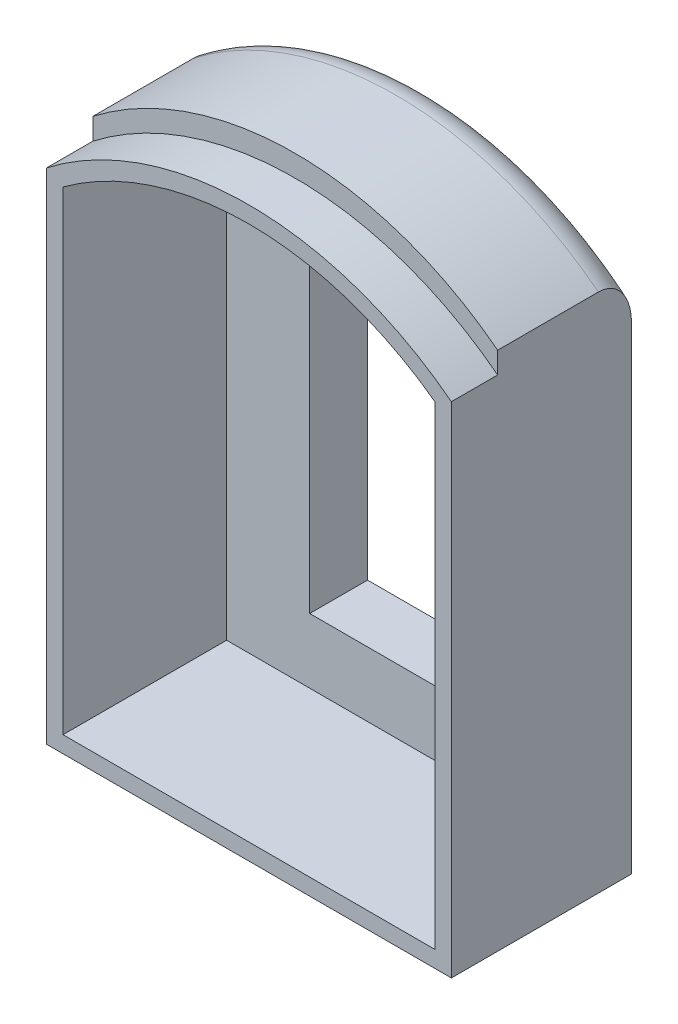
ISO-10303-21;
HEADER;
FILE_DESCRIPTION(('STEP AP214'),'2;1');
FILE_NAME('part.step','',(''),(''),'','','');
FILE_SCHEMA(('AUTOMOTIVE_DESIGN { 1 0 10303 214 1 1 1 1 }'));
ENDSEC;
DATA;
#1=APPLICATION_CONTEXT('core data for automotive mechanical design processes');
#2=APPLICATION_PROTOCOL_DEFINITION('international standard','automotive_design',2000,#1);
#3=PRODUCT_CONTEXT('',#1,'mechanical');
#4=PRODUCT('Part','Part','',(#3));
#5=PRODUCT_RELATED_PRODUCT_CATEGORY('part','',(#4));
#6=PRODUCT_DEFINITION_FORMATION('','',#4);
#7=PRODUCT_DEFINITION_CONTEXT('part definition',#1,'design');
#8=PRODUCT_DEFINITION('design','',#6,#7);
#9=PRODUCT_DEFINITION_SHAPE('','',#8);
#10=(LENGTH_UNIT() NAMED_UNIT(*) SI_UNIT(.MILLI.,.METRE.));
#11=(NAMED_UNIT(*) PLANE_ANGLE_UNIT() SI_UNIT($,.RADIAN.));
#12=(NAMED_UNIT(*) SI_UNIT($,.STERADIAN.) SOLID_ANGLE_UNIT());
#13=UNCERTAINTY_MEASURE_WITH_UNIT(LENGTH_MEASURE(1.E-05),#10,'distance_accuracy_value','');
#14=(GEOMETRIC_REPRESENTATION_CONTEXT(3) GLOBAL_UNCERTAINTY_ASSIGNED_CONTEXT((#13)) GLOBAL_UNIT_ASSIGNED_CONTEXT((#10,
#11,#12)) REPRESENTATION_CONTEXT('',''));
#15=CARTESIAN_POINT('',(0.,0.,0.));
#16=DIRECTION('',(0.,0.,1.));
#17=DIRECTION('',(1.,0.,0.));
#18=AXIS2_PLACEMENT_3D('',#15,#16,#17);
#19=CARTESIAN_POINT('',(0.,14.3905882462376,0.1));
#20=DIRECTION('',(0.,0.,1.));
#21=DIRECTION('',(1.,0.,0.));
#22=AXIS2_PLACEMENT_3D('',#19,#20,#21);
#23=PLANE('',#22);
#24=CARTESIAN_POINT('',(0.,14.3905882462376,0.1));
#25=DIRECTION('',(0.,0.,1.));
#26=DIRECTION('',(1.,0.,0.));
#27=AXIS2_PLACEMENT_3D('',#24,#25,#26);
#28=CIRCLE('',#27,19.);
#29=CARTESIAN_POINT('',(11.25,29.7019402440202,0.1));
#30=VERTEX_POINT('',#29);
#31=CARTESIAN_POINT('',(-11.25,29.7019402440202,0.1));
#32=VERTEX_POINT('',#31);
#33=EDGE_CURVE('E269',#30,#32,#28,.T.);
#34=ORIENTED_EDGE('',*,*,#33,.T.);
#35=DIRECTION('',(0.,-1.,0.));
#36=VECTOR('',#35,1.);
#37=CARTESIAN_POINT('',(-11.25,29.7019402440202,0.1));
#38=LINE('',#37,#36);
#39=CARTESIAN_POINT('',(-11.25,1.,0.1));
#40=VERTEX_POINT('',#39);
#41=EDGE_CURVE('E273',#32,#40,#38,.T.);
#42=ORIENTED_EDGE('',*,*,#41,.T.);
#43=DIRECTION('',(1.,0.,0.));
#44=VECTOR('',#43,1.);
#45=CARTESIAN_POINT('',(-11.25,1.,0.1));
#46=LINE('',#45,#44);
#47=CARTESIAN_POINT('',(11.25,1.,0.1));
#48=VERTEX_POINT('',#47);
#49=EDGE_CURVE('E277',#40,#48,#46,.T.);
#50=ORIENTED_EDGE('',*,*,#49,.T.);
#51=DIRECTION('',(0.,1.,0.));
#52=VECTOR('',#51,1.);
#53=CARTESIAN_POINT('',(11.25,1.,0.1));
#54=LINE('',#53,#52);
#55=EDGE_CURVE('E281',#48,#30,#54,.T.);
#56=ORIENTED_EDGE('',*,*,#55,.T.);
#57=EDGE_LOOP('',(#34,#42,#50,#56));
#58=FACE_BOUND('',#57,.T.);
#59=DIRECTION('',(1.,0.,0.));
#60=VECTOR('',#59,1.);
#61=CARTESIAN_POINT('',(-6.223,23.9645624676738,0.0999999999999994));
#62=LINE('',#61,#60);
#63=CARTESIAN_POINT('',(-6.223,23.9645624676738,0.0999999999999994));
#64=VERTEX_POINT('',#63);
#65=CARTESIAN_POINT('',(6.223,23.9645624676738,0.0999999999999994));
#66=VERTEX_POINT('',#65);
#67=EDGE_CURVE('E204',#64,#66,#62,.T.);
#68=ORIENTED_EDGE('',*,*,#67,.T.);
#69=DIRECTION('',(0.,-1.,0.));
#70=VECTOR('',#69,1.);
#71=CARTESIAN_POINT('',(6.223,4.9145624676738,0.0999999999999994));
#72=LINE('',#71,#70);
#73=CARTESIAN_POINT('',(6.223,4.9145624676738,0.0999999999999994));
#74=VERTEX_POINT('',#73);
#75=EDGE_CURVE('E237',#66,#74,#72,.T.);
#76=ORIENTED_EDGE('',*,*,#75,.T.);
#77=DIRECTION('',(-1.,0.,0.));
#78=VECTOR('',#77,1.);
#79=CARTESIAN_POINT('',(-6.223,4.9145624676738,0.0999999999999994));
#80=LINE('',#79,#78);
#81=CARTESIAN_POINT('',(-6.223,4.9145624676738,0.0999999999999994));
#82=VERTEX_POINT('',#81);
#83=EDGE_CURVE('E226',#74,#82,#80,.T.);
#84=ORIENTED_EDGE('',*,*,#83,.T.);
#85=DIRECTION('',(0.,1.,0.));
#86=VECTOR('',#85,1.);
#87=CARTESIAN_POINT('',(-6.223,4.9145624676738,0.0999999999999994));
#88=LINE('',#87,#86);
#89=EDGE_CURVE('E209',#82,#64,#88,.T.);
#90=ORIENTED_EDGE('',*,*,#89,.T.);
#91=EDGE_LOOP('',(#68,#76,#84,#90));
#92=FACE_BOUND('',#91,.T.);
#93=ADVANCED_FACE('F39',(#58,#92),#23,.T.);
#94=CARTESIAN_POINT('',(0.,15.6905882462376,-0.9));
#95=DIRECTION('',(0.,0.,-1.));
#96=DIRECTION('',(-1.,0.,0.));
#97=AXIS2_PLACEMENT_3D('',#94,#95,#96);
#98=PLANE('',#97);
#99=DIRECTION('',(-1.,0.,0.));
#100=VECTOR('',#99,1.);
#101=CARTESIAN_POINT('',(0.,1.9145624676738,-0.9));
#102=LINE('',#101,#100);
#103=CARTESIAN_POINT('',(-9.223,1.9145624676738,-0.9));
#104=VERTEX_POINT('',#103);
#105=CARTESIAN_POINT('',(9.223,1.9145624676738,-0.9));
#106=VERTEX_POINT('',#105);
#107=EDGE_CURVE('E454',#104,#106,#102,.F.);
#108=ORIENTED_EDGE('',*,*,#107,.T.);
#109=DIRECTION('',(0.,-1.,0.));
#110=VECTOR('',#109,1.);
#111=CARTESIAN_POINT('',(9.223,15.6905882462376,-0.9));
#112=LINE('',#111,#110);
#113=CARTESIAN_POINT('',(9.223,26.9645624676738,-0.9));
#114=VERTEX_POINT('',#113);
#115=EDGE_CURVE('E11',#106,#114,#112,.F.);
#116=ORIENTED_EDGE('',*,*,#115,.T.);
#117=DIRECTION('',(1.,0.,0.));
#118=VECTOR('',#117,1.);
#119=CARTESIAN_POINT('',(0.,26.9645624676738,-0.9));
#120=LINE('',#119,#118);
#121=CARTESIAN_POINT('',(-9.223,26.9645624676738,-0.9));
#122=VERTEX_POINT('',#121);
#123=EDGE_CURVE('E49',#114,#122,#120,.F.);
#124=ORIENTED_EDGE('',*,*,#123,.T.);
#125=DIRECTION('',(0.,1.,0.));
#126=VECTOR('',#125,1.);
#127=CARTESIAN_POINT('',(-9.223,15.6905882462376,-0.9));
#128=LINE('',#127,#126);
#129=EDGE_CURVE('E457',#122,#104,#128,.F.);
#130=ORIENTED_EDGE('',*,*,#129,.T.);
#131=EDGE_LOOP('',(#108,#116,#124,#130));
#132=FACE_BOUND('',#131,.T.);
#133=DIRECTION('',(0.,1.,0.));
#134=VECTOR('',#133,1.);
#135=CARTESIAN_POINT('',(-12.25,0.,-0.9));
#136=LINE('',#135,#134);
#137=CARTESIAN_POINT('',(-12.25,0.,-0.9));
#138=VERTEX_POINT('',#137);
#139=CARTESIAN_POINT('',(-12.25,28.8791249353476,-0.9));
#140=VERTEX_POINT('',#139);
#141=EDGE_CURVE('E289',#138,#140,#136,.T.);
#142=ORIENTED_EDGE('',*,*,#141,.T.);
#143=CARTESIAN_POINT('',(0.,15.6905882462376,-0.9));
#144=DIRECTION('',(0.,0.,-1.));
#145=DIRECTION('',(-1.,0.,0.));
#146=AXIS2_PLACEMENT_3D('',#143,#144,#145);
#147=CIRCLE('',#146,18.);
#148=CARTESIAN_POINT('',(12.25,28.8791249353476,-0.9));
#149=VERTEX_POINT('',#148);
#150=EDGE_CURVE('E371',#140,#149,#147,.T.);
#151=ORIENTED_EDGE('',*,*,#150,.T.);
#152=DIRECTION('',(0.,-1.,0.));
#153=VECTOR('',#152,1.);
#154=CARTESIAN_POINT('',(12.25,31.5,-0.9));
#155=LINE('',#154,#153);
#156=CARTESIAN_POINT('',(12.25,0.,-0.9));
#157=VERTEX_POINT('',#156);
#158=EDGE_CURVE('E293',#149,#157,#155,.T.);
#159=ORIENTED_EDGE('',*,*,#158,.T.);
#160=DIRECTION('',(-1.,0.,0.));
#161=VECTOR('',#160,1.);
#162=CARTESIAN_POINT('',(12.25,0.,-0.9));
#163=LINE('',#162,#161);
#164=EDGE_CURVE('E285',#157,#138,#163,.T.);
#165=ORIENTED_EDGE('',*,*,#164,.T.);
#166=EDGE_LOOP('',(#142,#151,#159,#165));
#167=FACE_BOUND('',#166,.T.);
#168=ADVANCED_FACE('F494',(#132,#167),#98,.T.);
#169=CARTESIAN_POINT('',(0.,14.3905882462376,10.));
#170=DIRECTION('',(0.,0.,-1.));
#171=DIRECTION('',(-1.,0.,0.));
#172=AXIS2_PLACEMENT_3D('',#169,#170,#171);
#173=PLANE('',#172);
#174=CARTESIAN_POINT('',(0.,14.3905882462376,10.));
#175=DIRECTION('',(0.,0.,1.));
#176=DIRECTION('',(-1.,0.,0.));
#177=AXIS2_PLACEMENT_3D('',#174,#175,#176);
#178=CIRCLE('',#177,20.);
#179=CARTESIAN_POINT('',(12.25,30.2,10.));
#180=VERTEX_POINT('',#179);
#181=CARTESIAN_POINT('',(-12.25,30.2,10.));
#182=VERTEX_POINT('',#181);
#183=EDGE_CURVE('E323',#180,#182,#178,.T.);
#184=ORIENTED_EDGE('',*,*,#183,.T.);
#185=DIRECTION('',(0.,-1.,0.));
#186=VECTOR('',#185,1.);
#187=CARTESIAN_POINT('',(-12.25,30.2,10.));
#188=LINE('',#187,#186);
#189=CARTESIAN_POINT('',(-12.25,0.,10.));
#190=VERTEX_POINT('',#189);
#191=EDGE_CURVE('E348',#182,#190,#188,.T.);
#192=ORIENTED_EDGE('',*,*,#191,.T.);
#193=DIRECTION('',(1.,0.,0.));
#194=VECTOR('',#193,1.);
#195=CARTESIAN_POINT('',(-12.25,0.,10.));
#196=LINE('',#195,#194);
#197=CARTESIAN_POINT('',(12.25,0.,10.));
#198=VERTEX_POINT('',#197);
#199=EDGE_CURVE('E351',#190,#198,#196,.T.);
#200=ORIENTED_EDGE('',*,*,#199,.T.);
#201=DIRECTION('',(0.,1.,0.));
#202=VECTOR('',#201,1.);
#203=CARTESIAN_POINT('',(12.25,0.,10.));
#204=LINE('',#203,#202);
#205=EDGE_CURVE('E354',#198,#180,#204,.T.);
#206=ORIENTED_EDGE('',*,*,#205,.T.);
#207=EDGE_LOOP('',(#184,#192,#200,#206));
#208=FACE_BOUND('',#207,.T.);
#209=CARTESIAN_POINT('',(0.,14.3905882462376,10.));
#210=DIRECTION('',(0.,0.,-1.));
#211=DIRECTION('',(-1.,0.,0.));
#212=AXIS2_PLACEMENT_3D('',#209,#210,#211);
#213=CIRCLE('',#212,19.);
#214=CARTESIAN_POINT('',(11.25,29.7019402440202,10.));
#215=VERTEX_POINT('',#214);
#216=CARTESIAN_POINT('',(-11.25,29.7019402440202,10.));
#217=VERTEX_POINT('',#216);
#218=EDGE_CURVE('E316',#215,#217,#213,.F.);
#219=ORIENTED_EDGE('',*,*,#218,.F.);
#220=DIRECTION('',(0.,1.,0.));
#221=VECTOR('',#220,1.);
#222=CARTESIAN_POINT('',(11.25,14.3905882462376,10.));
#223=LINE('',#222,#221);
#224=CARTESIAN_POINT('',(11.25,1.,10.));
#225=VERTEX_POINT('',#224);
#226=EDGE_CURVE('E329',#225,#215,#223,.T.);
#227=ORIENTED_EDGE('',*,*,#226,.F.);
#228=DIRECTION('',(1.,0.,0.));
#229=VECTOR('',#228,1.);
#230=CARTESIAN_POINT('',(0.,1.,10.));
#231=LINE('',#230,#229);
#232=CARTESIAN_POINT('',(-11.25,1.,10.));
#233=VERTEX_POINT('',#232);
#234=EDGE_CURVE('E339',#233,#225,#231,.T.);
#235=ORIENTED_EDGE('',*,*,#234,.F.);
#236=DIRECTION('',(0.,-1.,0.));
#237=VECTOR('',#236,1.);
#238=CARTESIAN_POINT('',(-11.25,14.3905882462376,10.));
#239=LINE('',#238,#237);
#240=EDGE_CURVE('E336',#217,#233,#239,.T.);
#241=ORIENTED_EDGE('',*,*,#240,.F.);
#242=EDGE_LOOP('',(#219,#227,#235,#241));
#243=FACE_BOUND('',#242,.T.);
#244=ADVANCED_FACE('F398',(#208,#243),#173,.F.);
#245=CARTESIAN_POINT('',(0.,14.3905882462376,10.));
#246=DIRECTION('',(0.,0.,-1.));
#247=DIRECTION('',(-1.,0.,0.));
#248=AXIS2_PLACEMENT_3D('',#245,#246,#247);
#249=CYLINDRICAL_SURFACE('',#248,20.);
#250=DIRECTION('',(0.,0.,-1.));
#251=VECTOR('',#250,1.);
#252=CARTESIAN_POINT('',(12.25,30.2,10.));
#253=LINE('',#252,#251);
#254=CARTESIAN_POINT('',(12.25,30.2,7.2));
#255=VERTEX_POINT('',#254);
#256=EDGE_CURVE('E357',#180,#255,#253,.T.);
#257=ORIENTED_EDGE('',*,*,#256,.T.);
#258=CARTESIAN_POINT('',(0.,14.3905882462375,7.2));
#259=DIRECTION('',(0.,0.,1.));
#260=DIRECTION('',(1.,0.,0.));
#261=AXIS2_PLACEMENT_3D('',#258,#259,#260);
#262=CIRCLE('',#261,20.0000000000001);
#263=CARTESIAN_POINT('',(-12.25,30.2,7.2));
#264=VERTEX_POINT('',#263);
#265=EDGE_CURVE('E296',#255,#264,#262,.T.);
#266=ORIENTED_EDGE('',*,*,#265,.T.);
#267=DIRECTION('',(0.,0.,-1.));
#268=VECTOR('',#267,1.);
#269=CARTESIAN_POINT('',(-12.25,30.2,10.));
#270=LINE('',#269,#268);
#271=EDGE_CURVE('E367',#182,#264,#270,.T.);
#272=ORIENTED_EDGE('',*,*,#271,.F.);
#273=ORIENTED_EDGE('',*,*,#183,.F.);
#274=EDGE_LOOP('',(#257,#266,#272,#273));
#275=FACE_BOUND('',#274,.T.);
#276=ADVANCED_FACE('F406',(#275),#249,.T.);
#277=CARTESIAN_POINT('',(-12.25,30.2,10.));
#278=DIRECTION('',(1.,0.,0.));
#279=DIRECTION('',(0.,1.,0.));
#280=AXIS2_PLACEMENT_3D('',#277,#278,#279);
#281=PLANE('',#280);
#282=DIRECTION('',(0.,0.,-1.));
#283=VECTOR('',#282,1.);
#284=CARTESIAN_POINT('',(-12.25,31.5,7.2));
#285=LINE('',#284,#283);
#286=CARTESIAN_POINT('',(-12.25,31.5,7.2));
#287=VERTEX_POINT('',#286);
#288=CARTESIAN_POINT('',(-12.25,31.5,1.1));
#289=VERTEX_POINT('',#288);
#290=EDGE_CURVE('E311',#287,#289,#285,.T.);
#291=ORIENTED_EDGE('',*,*,#290,.T.);
#292=CARTESIAN_POINT('',(-12.25,31.5,1.1));
#293=CARTESIAN_POINT('',(-12.25,31.5000117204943,1.05233008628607));
#294=CARTESIAN_POINT('',(-12.25,31.4978442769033,1.00466614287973));
#295=CARTESIAN_POINT('',(-12.25,31.4892408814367,0.90974679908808));
#296=CARTESIAN_POINT('',(-12.25,31.4828069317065,0.862491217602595));
#297=CARTESIAN_POINT('',(-12.25,31.4658089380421,0.769007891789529));
#298=CARTESIAN_POINT('',(-12.25,31.4552687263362,0.722775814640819));
#299=CARTESIAN_POINT('',(-12.25,31.4302297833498,0.631407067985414));
#300=CARTESIAN_POINT('',(-12.25,31.4157307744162,0.586270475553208));
#301=CARTESIAN_POINT('',(-12.25,31.3666402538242,0.453107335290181));
#302=CARTESIAN_POINT('',(-12.25,31.326412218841,0.367097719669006));
#303=CARTESIAN_POINT('',(-12.25,31.2329664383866,0.20245276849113));
#304=CARTESIAN_POINT('',(-12.25,31.1797324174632,0.123826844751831));
#305=CARTESIAN_POINT('',(-12.25,31.0586120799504,-0.0298426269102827));
#306=CARTESIAN_POINT('',(-12.25,30.9899878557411,-0.104302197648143));
#307=CARTESIAN_POINT('',(-12.25,30.8431031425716,-0.242882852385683));
#308=CARTESIAN_POINT('',(-12.25,30.7648414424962,-0.307002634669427));
#309=CARTESIAN_POINT('',(-12.25,30.5612032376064,-0.453346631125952));
#310=CARTESIAN_POINT('',(-12.25,30.4313329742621,-0.529349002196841));
#311=CARTESIAN_POINT('',(-12.25,30.1607119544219,-0.659435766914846));
#312=CARTESIAN_POINT('',(-12.25,30.0199201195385,-0.713432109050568));
#313=CARTESIAN_POINT('',(-12.25,29.7139928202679,-0.806022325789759));
#314=CARTESIAN_POINT('',(-12.25,29.5480170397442,-0.841839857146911));
#315=CARTESIAN_POINT('',(-12.25,29.2974295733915,-0.877050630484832));
#316=CARTESIAN_POINT('',(-12.25,29.2139726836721,-0.885703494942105));
#317=CARTESIAN_POINT('',(-12.25,29.046727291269,-0.897170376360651));
#318=CARTESIAN_POINT('',(-12.25,28.9629391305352,-0.89998934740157));
#319=CARTESIAN_POINT('',(-12.25,28.8791249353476,-0.9));
#320=B_SPLINE_CURVE_WITH_KNOTS('',3,(#292,#293,#294,#295,#296,#297,#298,#299,#300,#301,#302,
#303,#304,#305,#306,#307,#308,#309,#310,#311,#312,#313,#314,#315,#316,#317,#318,#319),
.UNSPECIFIED.,.F.,.F.,(4,2,2,2,2,2,2,2,2,2,2,2,2,4),(0.,0.142950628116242,0.285834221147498,
0.42790060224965,0.569976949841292,0.853437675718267,1.13725495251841,1.43990654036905,
1.74259620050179,2.19153911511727,2.64226112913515,3.14943783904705,3.40098688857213,
3.65232223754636),.UNSPECIFIED.);
#321=EDGE_CURVE('E408',#289,#140,#320,.T.);
#322=ORIENTED_EDGE('',*,*,#321,.T.);
#323=ORIENTED_EDGE('',*,*,#141,.F.);
#324=DIRECTION('',(0.,0.,-1.));
#325=VECTOR('',#324,1.);
#326=CARTESIAN_POINT('',(-12.25,0.,10.));
#327=LINE('',#326,#325);
#328=EDGE_CURVE('E364',#190,#138,#327,.T.);
#329=ORIENTED_EDGE('',*,*,#328,.F.);
#330=ORIENTED_EDGE('',*,*,#191,.F.);
#331=ORIENTED_EDGE('',*,*,#271,.T.);
#332=DIRECTION('',(0.,1.,0.));
#333=VECTOR('',#332,1.);
#334=CARTESIAN_POINT('',(-12.25,30.2,7.2));
#335=LINE('',#334,#333);
#336=EDGE_CURVE('E299',#264,#287,#335,.T.);
#337=ORIENTED_EDGE('',*,*,#336,.T.);
#338=EDGE_LOOP('',(#291,#322,#323,#329,#330,#331,#337));
#339=FACE_BOUND('',#338,.T.);
#340=ADVANCED_FACE('F402',(#339),#281,.F.);
#341=CARTESIAN_POINT('',(-12.25,0.,10.));
#342=DIRECTION('',(0.,1.,0.));
#343=DIRECTION('',(0.,0.,1.));
#344=AXIS2_PLACEMENT_3D('',#341,#342,#343);
#345=PLANE('',#344);
#346=ORIENTED_EDGE('',*,*,#328,.T.);
#347=ORIENTED_EDGE('',*,*,#164,.F.);
#348=DIRECTION('',(0.,0.,-1.));
#349=VECTOR('',#348,1.);
#350=CARTESIAN_POINT('',(12.25,0.,10.));
#351=LINE('',#350,#349);
#352=EDGE_CURVE('E360',#198,#157,#351,.T.);
#353=ORIENTED_EDGE('',*,*,#352,.F.);
#354=ORIENTED_EDGE('',*,*,#199,.F.);
#355=EDGE_LOOP('',(#346,#347,#353,#354));
#356=FACE_BOUND('',#355,.T.);
#357=ADVANCED_FACE('F396',(#356),#345,.F.);
#358=CARTESIAN_POINT('',(12.25,0.,10.));
#359=DIRECTION('',(-1.,0.,0.));
#360=DIRECTION('',(0.,-1.,0.));
#361=AXIS2_PLACEMENT_3D('',#358,#359,#360);
#362=PLANE('',#361);
#363=ORIENTED_EDGE('',*,*,#158,.F.);
#364=CARTESIAN_POINT('',(12.25,28.8791249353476,-0.9));
#365=CARTESIAN_POINT('',(12.25,28.9632624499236,-0.899989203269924));
#366=CARTESIAN_POINT('',(12.25,29.0473733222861,-0.897148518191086));
#367=CARTESIAN_POINT('',(12.25,29.2152613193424,-0.885592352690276));
#368=CARTESIAN_POINT('',(12.25,29.2990380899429,-0.876871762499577));
#369=CARTESIAN_POINT('',(12.25,29.5503742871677,-0.841412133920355));
#370=CARTESIAN_POINT('',(12.25,29.7167698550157,-0.805368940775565));
#371=CARTESIAN_POINT('',(12.25,30.0199463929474,-0.713258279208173));
#372=CARTESIAN_POINT('',(12.25,30.1577280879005,-0.660480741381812));
#373=CARTESIAN_POINT('',(12.25,30.4229613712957,-0.533744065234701));
#374=CARTESIAN_POINT('',(12.25,30.5504418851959,-0.459847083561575));
#375=CARTESIAN_POINT('',(12.25,30.7652528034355,-0.307575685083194));
#376=CARTESIAN_POINT('',(12.25,30.8554474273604,-0.233250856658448));
#377=CARTESIAN_POINT('',(12.25,31.0226280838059,-0.0708793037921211));
#378=CARTESIAN_POINT('',(12.25,31.0996234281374,0.0171576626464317));
#379=CARTESIAN_POINT('',(12.25,31.2255672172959,0.190836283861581));
#380=CARTESIAN_POINT('',(12.25,31.2770257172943,0.274653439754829));
#381=CARTESIAN_POINT('',(12.25,31.3652444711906,0.449628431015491));
#382=CARTESIAN_POINT('',(12.25,31.4020284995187,0.540774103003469));
#383=CARTESIAN_POINT('',(12.25,31.4532668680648,0.709706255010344));
#384=CARTESIAN_POINT('',(12.25,31.4706908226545,0.786592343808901));
#385=CARTESIAN_POINT('',(12.25,31.488222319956,0.903290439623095));
#386=CARTESIAN_POINT('',(12.25,31.492632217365,0.9424896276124));
#387=CARTESIAN_POINT('',(12.25,31.49852312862,1.02112149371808));
#388=CARTESIAN_POINT('',(12.25,31.5000030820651,1.0605542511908));
#389=CARTESIAN_POINT('',(12.25,31.5,1.1));
#390=B_SPLINE_CURVE_WITH_KNOTS('',3,(#364,#365,#366,#367,#368,#369,#370,#371,#372,#373,#374,
#375,#376,#377,#378,#379,#380,#381,#382,#383,#384,#385,#386,#387,#388,#389),.UNSPECIFIED.,.F.,
.F.,(4,2,2,2,2,2,2,2,2,2,2,2,4),(0.,0.25230341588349,0.504826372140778,1.01335050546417,
1.45442761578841,1.89421972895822,2.24352372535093,2.59258027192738,2.88641449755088,
3.17977072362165,3.41540243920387,3.5336439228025,3.65192819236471),.UNSPECIFIED.);
#391=CARTESIAN_POINT('',(12.25,31.5,1.1));
#392=VERTEX_POINT('',#391);
#393=EDGE_CURVE('E375',#149,#392,#390,.T.);
#394=ORIENTED_EDGE('',*,*,#393,.T.);
#395=DIRECTION('',(0.,0.,-1.));
#396=VECTOR('',#395,1.);
#397=CARTESIAN_POINT('',(12.25,31.5,7.2));
#398=LINE('',#397,#396);
#399=CARTESIAN_POINT('',(12.25,31.5,7.2));
#400=VERTEX_POINT('',#399);
#401=EDGE_CURVE('E312',#400,#392,#398,.T.);
#402=ORIENTED_EDGE('',*,*,#401,.F.);
#403=DIRECTION('',(0.,-1.,0.));
#404=VECTOR('',#403,1.);
#405=CARTESIAN_POINT('',(12.25,30.2,7.2));
#406=LINE('',#405,#404);
#407=EDGE_CURVE('E307',#400,#255,#406,.T.);
#408=ORIENTED_EDGE('',*,*,#407,.T.);
#409=ORIENTED_EDGE('',*,*,#256,.F.);
#410=ORIENTED_EDGE('',*,*,#205,.F.);
#411=ORIENTED_EDGE('',*,*,#352,.T.);
#412=EDGE_LOOP('',(#363,#394,#402,#408,#409,#410,#411));
#413=FACE_BOUND('',#412,.T.);
#414=ADVANCED_FACE('F390',(#413),#362,.F.);
#415=CARTESIAN_POINT('',(0.,14.3905882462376,10.));
#416=DIRECTION('',(0.,0.,-1.));
#417=DIRECTION('',(-1.,0.,0.));
#418=AXIS2_PLACEMENT_3D('',#415,#416,#417);
#419=CYLINDRICAL_SURFACE('',#418,19.);
#420=DIRECTION('',(0.,0.,-1.));
#421=VECTOR('',#420,1.);
#422=CARTESIAN_POINT('',(-11.25,29.7019402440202,10.));
#423=LINE('',#422,#421);
#424=EDGE_CURVE('E320',#217,#32,#423,.T.);
#425=ORIENTED_EDGE('',*,*,#424,.T.);
#426=ORIENTED_EDGE('',*,*,#33,.F.);
#427=DIRECTION('',(0.,0.,-1.));
#428=VECTOR('',#427,1.);
#429=CARTESIAN_POINT('',(11.25,29.7019402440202,10.));
#430=LINE('',#429,#428);
#431=EDGE_CURVE('E325',#215,#30,#430,.T.);
#432=ORIENTED_EDGE('',*,*,#431,.F.);
#433=ORIENTED_EDGE('',*,*,#218,.T.);
#434=EDGE_LOOP('',(#425,#426,#432,#433));
#435=FACE_BOUND('',#434,.T.);
#436=ADVANCED_FACE('F395',(#435),#419,.F.);
#437=CARTESIAN_POINT('',(-11.25,30.2,10.));
#438=DIRECTION('',(1.,0.,0.));
#439=DIRECTION('',(0.,1.,0.));
#440=AXIS2_PLACEMENT_3D('',#437,#438,#439);
#441=PLANE('',#440);
#442=DIRECTION('',(0.,0.,-1.));
#443=VECTOR('',#442,1.);
#444=CARTESIAN_POINT('',(-11.25,1.,10.));
#445=LINE('',#444,#443);
#446=EDGE_CURVE('E324',#233,#40,#445,.T.);
#447=ORIENTED_EDGE('',*,*,#446,.T.);
#448=ORIENTED_EDGE('',*,*,#41,.F.);
#449=ORIENTED_EDGE('',*,*,#424,.F.);
#450=ORIENTED_EDGE('',*,*,#240,.T.);
#451=EDGE_LOOP('',(#447,#448,#449,#450));
#452=FACE_BOUND('',#451,.T.);
#453=ADVANCED_FACE('F558',(#452),#441,.T.);
#454=CARTESIAN_POINT('',(-12.25,1.,10.));
#455=DIRECTION('',(0.,1.,0.));
#456=DIRECTION('',(0.,0.,1.));
#457=AXIS2_PLACEMENT_3D('',#454,#455,#456);
#458=PLANE('',#457);
#459=DIRECTION('',(0.,0.,-1.));
#460=VECTOR('',#459,1.);
#461=CARTESIAN_POINT('',(11.25,1.,10.));
#462=LINE('',#461,#460);
#463=EDGE_CURVE('E328',#225,#48,#462,.T.);
#464=ORIENTED_EDGE('',*,*,#463,.T.);
#465=ORIENTED_EDGE('',*,*,#49,.F.);
#466=ORIENTED_EDGE('',*,*,#446,.F.);
#467=ORIENTED_EDGE('',*,*,#234,.T.);
#468=EDGE_LOOP('',(#464,#465,#466,#467));
#469=FACE_BOUND('',#468,.T.);
#470=ADVANCED_FACE('F562',(#469),#458,.T.);
#471=CARTESIAN_POINT('',(11.25,0.,10.));
#472=DIRECTION('',(-1.,0.,0.));
#473=DIRECTION('',(0.,-1.,0.));
#474=AXIS2_PLACEMENT_3D('',#471,#472,#473);
#475=PLANE('',#474);
#476=ORIENTED_EDGE('',*,*,#431,.T.);
#477=ORIENTED_EDGE('',*,*,#55,.F.);
#478=ORIENTED_EDGE('',*,*,#463,.F.);
#479=ORIENTED_EDGE('',*,*,#226,.T.);
#480=EDGE_LOOP('',(#476,#477,#478,#479));
#481=FACE_BOUND('',#480,.T.);
#482=ADVANCED_FACE('F554',(#481),#475,.T.);
#483=CARTESIAN_POINT('',(0.,15.6905882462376,7.2));
#484=DIRECTION('',(0.,0.,-1.));
#485=DIRECTION('',(-1.,0.,0.));
#486=AXIS2_PLACEMENT_3D('',#483,#484,#485);
#487=CYLINDRICAL_SURFACE('',#486,20.);
#488=ORIENTED_EDGE('',*,*,#401,.T.);
#489=CARTESIAN_POINT('',(0.,15.6905882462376,1.1));
#490=DIRECTION('',(0.,0.,-1.));
#491=DIRECTION('',(-1.,0.,0.));
#492=AXIS2_PLACEMENT_3D('',#489,#490,#491);
#493=CIRCLE('',#492,20.);
#494=EDGE_CURVE('E384',#392,#289,#493,.F.);
#495=ORIENTED_EDGE('',*,*,#494,.T.);
#496=ORIENTED_EDGE('',*,*,#290,.F.);
#497=CARTESIAN_POINT('',(0.,15.6905882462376,7.2));
#498=DIRECTION('',(0.,0.,-1.));
#499=DIRECTION('',(1.,0.,0.));
#500=AXIS2_PLACEMENT_3D('',#497,#498,#499);
#501=CIRCLE('',#500,20.);
#502=EDGE_CURVE('E303',#287,#400,#501,.T.);
#503=ORIENTED_EDGE('',*,*,#502,.T.);
#504=EDGE_LOOP('',(#488,#495,#496,#503));
#505=FACE_BOUND('',#504,.T.);
#506=ADVANCED_FACE('F550',(#505),#487,.T.);
#507=CARTESIAN_POINT('',(0.,14.3905882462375,7.2));
#508=DIRECTION('',(0.,0.,1.));
#509=DIRECTION('',(1.,0.,0.));
#510=AXIS2_PLACEMENT_3D('',#507,#508,#509);
#511=PLANE('',#510);
#512=ORIENTED_EDGE('',*,*,#265,.F.);
#513=ORIENTED_EDGE('',*,*,#407,.F.);
#514=ORIENTED_EDGE('',*,*,#502,.F.);
#515=ORIENTED_EDGE('',*,*,#336,.F.);
#516=EDGE_LOOP('',(#512,#513,#514,#515));
#517=FACE_BOUND('',#516,.T.);
#518=ADVANCED_FACE('F547',(#517),#511,.T.);
#519=CARTESIAN_POINT('',(0.,15.6905882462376,1.1));
#520=DIRECTION('',(0.,0.,-1.));
#521=DIRECTION('',(-1.,0.,0.));
#522=AXIS2_PLACEMENT_3D('',#519,#520,#521);
#523=TOROIDAL_SURFACE('',#522,18.,2.);
#524=ORIENTED_EDGE('',*,*,#321,.F.);
#525=ORIENTED_EDGE('',*,*,#494,.F.);
#526=ORIENTED_EDGE('',*,*,#393,.F.);
#527=ORIENTED_EDGE('',*,*,#150,.F.);
#528=EDGE_LOOP('',(#524,#525,#526,#527));
#529=FACE_BOUND('',#528,.T.);
#530=ADVANCED_FACE('F386',(#529),#523,.T.);
#531=CARTESIAN_POINT('',(8.223,2.9145624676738,-3.4));
#532=DIRECTION('',(-1.,0.,0.));
#533=DIRECTION('',(0.,0.,1.));
#534=AXIS2_PLACEMENT_3D('',#531,#532,#533);
#535=PLANE('',#534);
#536=DIRECTION('',(0.,0.,1.));
#537=VECTOR('',#536,1.);
#538=CARTESIAN_POINT('',(8.223,2.9145624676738,-3.4));
#539=LINE('',#538,#537);
#540=CARTESIAN_POINT('',(8.223,2.9145624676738,-2.4));
#541=VERTEX_POINT('',#540);
#542=CARTESIAN_POINT('',(8.223,2.9145624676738,-1.9));
#543=VERTEX_POINT('',#542);
#544=EDGE_CURVE('E265',#541,#543,#539,.T.);
#545=ORIENTED_EDGE('',*,*,#544,.F.);
#546=DIRECTION('',(0.,-1.,0.));
#547=VECTOR('',#546,1.);
#548=CARTESIAN_POINT('',(8.223,25.9645624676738,-2.4));
#549=LINE('',#548,#547);
#550=CARTESIAN_POINT('',(8.223,25.9645624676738,-2.4));
#551=VERTEX_POINT('',#550);
#552=EDGE_CURVE('E451',#541,#551,#549,.F.);
#553=ORIENTED_EDGE('',*,*,#552,.T.);
#554=DIRECTION('',(0.,0.,1.));
#555=VECTOR('',#554,1.);
#556=CARTESIAN_POINT('',(8.223,25.9645624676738,-3.4));
#557=LINE('',#556,#555);
#558=CARTESIAN_POINT('',(8.223,25.9645624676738,-1.9));
#559=VERTEX_POINT('',#558);
#560=EDGE_CURVE('E253',#551,#559,#557,.T.);
#561=ORIENTED_EDGE('',*,*,#560,.T.);
#562=DIRECTION('',(0.,-1.,0.));
#563=VECTOR('',#562,1.);
#564=CARTESIAN_POINT('',(8.223,2.9145624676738,-1.9));
#565=LINE('',#564,#563);
#566=EDGE_CURVE('E447',#559,#543,#565,.T.);
#567=ORIENTED_EDGE('',*,*,#566,.T.);
#568=EDGE_LOOP('',(#545,#553,#561,#567));
#569=FACE_BOUND('',#568,.T.);
#570=ADVANCED_FACE('F503',(#569),#535,.F.);
#571=CARTESIAN_POINT('',(-8.223,2.9145624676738,-3.4));
#572=DIRECTION('',(0.,1.,0.));
#573=DIRECTION('',(-1.,0.,0.));
#574=AXIS2_PLACEMENT_3D('',#571,#572,#573);
#575=PLANE('',#574);
#576=DIRECTION('',(0.,0.,1.));
#577=VECTOR('',#576,1.);
#578=CARTESIAN_POINT('',(-8.223,2.9145624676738,-3.4));
#579=LINE('',#578,#577);
#580=CARTESIAN_POINT('',(-8.223,2.9145624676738,-2.4));
#581=VERTEX_POINT('',#580);
#582=CARTESIAN_POINT('',(-8.223,2.9145624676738,-1.9));
#583=VERTEX_POINT('',#582);
#584=EDGE_CURVE('E261',#581,#583,#579,.T.);
#585=ORIENTED_EDGE('',*,*,#584,.F.);
#586=DIRECTION('',(-1.,0.,0.));
#587=VECTOR('',#586,1.);
#588=CARTESIAN_POINT('',(8.223,2.9145624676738,-2.4));
#589=LINE('',#588,#587);
#590=EDGE_CURVE('E444',#581,#541,#589,.F.);
#591=ORIENTED_EDGE('',*,*,#590,.T.);
#592=ORIENTED_EDGE('',*,*,#544,.T.);
#593=DIRECTION('',(-1.,0.,0.));
#594=VECTOR('',#593,1.);
#595=CARTESIAN_POINT('',(-8.223,2.9145624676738,-1.9));
#596=LINE('',#595,#594);
#597=EDGE_CURVE('E441',#543,#583,#596,.T.);
#598=ORIENTED_EDGE('',*,*,#597,.T.);
#599=EDGE_LOOP('',(#585,#591,#592,#598));
#600=FACE_BOUND('',#599,.T.);
#601=ADVANCED_FACE('F506',(#600),#575,.F.);
#602=CARTESIAN_POINT('',(-8.223,2.9145624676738,-3.4));
#603=DIRECTION('',(1.,0.,0.));
#604=DIRECTION('',(0.,0.,-1.));
#605=AXIS2_PLACEMENT_3D('',#602,#603,#604);
#606=PLANE('',#605);
#607=DIRECTION('',(0.,0.,1.));
#608=VECTOR('',#607,1.);
#609=CARTESIAN_POINT('',(-8.223,25.9645624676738,-3.4));
#610=LINE('',#609,#608);
#611=CARTESIAN_POINT('',(-8.223,25.9645624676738,-2.4));
#612=VERTEX_POINT('',#611);
#613=CARTESIAN_POINT('',(-8.223,25.9645624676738,-1.9));
#614=VERTEX_POINT('',#613);
#615=EDGE_CURVE('E257',#612,#614,#610,.T.);
#616=ORIENTED_EDGE('',*,*,#615,.F.);
#617=DIRECTION('',(0.,1.,0.));
#618=VECTOR('',#617,1.);
#619=CARTESIAN_POINT('',(-8.223,2.9145624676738,-2.4));
#620=LINE('',#619,#618);
#621=EDGE_CURVE('E438',#612,#581,#620,.F.);
#622=ORIENTED_EDGE('',*,*,#621,.T.);
#623=ORIENTED_EDGE('',*,*,#584,.T.);
#624=DIRECTION('',(0.,1.,0.));
#625=VECTOR('',#624,1.);
#626=CARTESIAN_POINT('',(-8.223,2.9145624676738,-1.9));
#627=LINE('',#626,#625);
#628=EDGE_CURVE('E435',#583,#614,#627,.T.);
#629=ORIENTED_EDGE('',*,*,#628,.T.);
#630=EDGE_LOOP('',(#616,#622,#623,#629));
#631=FACE_BOUND('',#630,.T.);
#632=ADVANCED_FACE('F614',(#631),#606,.F.);
#633=CARTESIAN_POINT('',(-8.223,25.9645624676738,-3.4));
#634=DIRECTION('',(0.,-1.,0.));
#635=DIRECTION('',(0.,0.,-1.));
#636=AXIS2_PLACEMENT_3D('',#633,#634,#635);
#637=PLANE('',#636);
#638=ORIENTED_EDGE('',*,*,#560,.F.);
#639=DIRECTION('',(1.,0.,0.));
#640=VECTOR('',#639,1.);
#641=CARTESIAN_POINT('',(-8.223,25.9645624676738,-2.4));
#642=LINE('',#641,#640);
#643=EDGE_CURVE('E431',#551,#612,#642,.F.);
#644=ORIENTED_EDGE('',*,*,#643,.T.);
#645=ORIENTED_EDGE('',*,*,#615,.T.);
#646=DIRECTION('',(1.,0.,0.));
#647=VECTOR('',#646,1.);
#648=CARTESIAN_POINT('',(-8.223,25.9645624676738,-1.9));
#649=LINE('',#648,#647);
#650=EDGE_CURVE('E428',#614,#559,#649,.T.);
#651=ORIENTED_EDGE('',*,*,#650,.T.);
#652=EDGE_LOOP('',(#638,#644,#645,#651));
#653=FACE_BOUND('',#652,.T.);
#654=ADVANCED_FACE('F526',(#653),#637,.F.);
#655=CARTESIAN_POINT('',(0.,0.,-3.4));
#656=DIRECTION('',(0.,0.,-1.));
#657=DIRECTION('',(-1.,0.,0.));
#658=AXIS2_PLACEMENT_3D('',#655,#656,#657);
#659=PLANE('',#658);
#660=DIRECTION('',(0.,1.,0.));
#661=VECTOR('',#660,1.);
#662=CARTESIAN_POINT('',(-7.223,25.9645624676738,-3.4));
#663=LINE('',#662,#661);
#664=CARTESIAN_POINT('',(-7.223,3.9145624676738,-3.4));
#665=VERTEX_POINT('',#664);
#666=CARTESIAN_POINT('',(-7.223,24.9645624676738,-3.4));
#667=VERTEX_POINT('',#666);
#668=EDGE_CURVE('E421',#665,#667,#663,.T.);
#669=ORIENTED_EDGE('',*,*,#668,.T.);
#670=DIRECTION('',(1.,0.,0.));
#671=VECTOR('',#670,1.);
#672=CARTESIAN_POINT('',(8.223,24.9645624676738,-3.4));
#673=LINE('',#672,#671);
#674=CARTESIAN_POINT('',(7.223,24.9645624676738,-3.4));
#675=VERTEX_POINT('',#674);
#676=EDGE_CURVE('E424',#667,#675,#673,.T.);
#677=ORIENTED_EDGE('',*,*,#676,.T.);
#678=DIRECTION('',(0.,-1.,0.));
#679=VECTOR('',#678,1.);
#680=CARTESIAN_POINT('',(7.223,2.9145624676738,-3.4));
#681=LINE('',#680,#679);
#682=CARTESIAN_POINT('',(7.223,3.9145624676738,-3.4));
#683=VERTEX_POINT('',#682);
#684=EDGE_CURVE('E415',#675,#683,#681,.T.);
#685=ORIENTED_EDGE('',*,*,#684,.T.);
#686=DIRECTION('',(-1.,0.,0.));
#687=VECTOR('',#686,1.);
#688=CARTESIAN_POINT('',(-8.223,3.9145624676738,-3.4));
#689=LINE('',#688,#687);
#690=EDGE_CURVE('E418',#683,#665,#689,.T.);
#691=ORIENTED_EDGE('',*,*,#690,.T.);
#692=EDGE_LOOP('',(#669,#677,#685,#691));
#693=FACE_BOUND('',#692,.T.);
#694=DIRECTION('',(-1.,0.,0.));
#695=VECTOR('',#694,1.);
#696=CARTESIAN_POINT('',(-6.223,4.9145624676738,-3.4));
#697=LINE('',#696,#695);
#698=CARTESIAN_POINT('',(6.223,4.9145624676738,-3.4));
#699=VERTEX_POINT('',#698);
#700=CARTESIAN_POINT('',(-6.223,4.9145624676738,-3.4));
#701=VERTEX_POINT('',#700);
#702=EDGE_CURVE('E219',#699,#701,#697,.T.);
#703=ORIENTED_EDGE('',*,*,#702,.F.);
#704=DIRECTION('',(0.,-1.,0.));
#705=VECTOR('',#704,1.);
#706=CARTESIAN_POINT('',(6.223,4.9145624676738,-3.4));
#707=LINE('',#706,#705);
#708=CARTESIAN_POINT('',(6.223,23.9645624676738,-3.4));
#709=VERTEX_POINT('',#708);
#710=EDGE_CURVE('E224',#709,#699,#707,.T.);
#711=ORIENTED_EDGE('',*,*,#710,.F.);
#712=DIRECTION('',(1.,0.,0.));
#713=VECTOR('',#712,1.);
#714=CARTESIAN_POINT('',(-6.223,23.9645624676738,-3.4));
#715=LINE('',#714,#713);
#716=CARTESIAN_POINT('',(-6.223,23.9645624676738,-3.4));
#717=VERTEX_POINT('',#716);
#718=EDGE_CURVE('E201',#717,#709,#715,.T.);
#719=ORIENTED_EDGE('',*,*,#718,.F.);
#720=DIRECTION('',(0.,1.,0.));
#721=VECTOR('',#720,1.);
#722=CARTESIAN_POINT('',(-6.223,4.9145624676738,-3.4));
#723=LINE('',#722,#721);
#724=EDGE_CURVE('E212',#701,#717,#723,.T.);
#725=ORIENTED_EDGE('',*,*,#724,.F.);
#726=EDGE_LOOP('',(#703,#711,#719,#725));
#727=FACE_BOUND('',#726,.T.);
#728=ADVANCED_FACE('F222',(#693,#727),#659,.T.);
#729=CARTESIAN_POINT('',(-6.223,4.9145624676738,22.8553381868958));
#730=DIRECTION('',(0.,-1.,0.));
#731=DIRECTION('',(0.,0.,-1.));
#732=AXIS2_PLACEMENT_3D('',#729,#730,#731);
#733=PLANE('',#732);
#734=DIRECTION('',(0.,0.,-1.));
#735=VECTOR('',#734,1.);
#736=CARTESIAN_POINT('',(6.223,4.9145624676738,22.8553381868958));
#737=LINE('',#736,#735);
#738=EDGE_CURVE('E241',#74,#699,#737,.T.);
#739=ORIENTED_EDGE('',*,*,#738,.T.);
#740=ORIENTED_EDGE('',*,*,#702,.T.);
#741=DIRECTION('',(0.,0.,-1.));
#742=VECTOR('',#741,1.);
#743=CARTESIAN_POINT('',(-6.223,4.9145624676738,22.8553381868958));
#744=LINE('',#743,#742);
#745=EDGE_CURVE('E214',#82,#701,#744,.T.);
#746=ORIENTED_EDGE('',*,*,#745,.F.);
#747=ORIENTED_EDGE('',*,*,#83,.F.);
#748=EDGE_LOOP('',(#739,#740,#746,#747));
#749=FACE_BOUND('',#748,.T.);
#750=ADVANCED_FACE('F625',(#749),#733,.F.);
#751=CARTESIAN_POINT('',(-6.223,4.9145624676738,22.8553381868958));
#752=DIRECTION('',(-1.,0.,0.));
#753=DIRECTION('',(0.,0.,1.));
#754=AXIS2_PLACEMENT_3D('',#751,#752,#753);
#755=PLANE('',#754);
#756=ORIENTED_EDGE('',*,*,#745,.T.);
#757=ORIENTED_EDGE('',*,*,#724,.T.);
#758=DIRECTION('',(0.,0.,-1.));
#759=VECTOR('',#758,1.);
#760=CARTESIAN_POINT('',(-6.223,23.9645624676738,22.8553381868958));
#761=LINE('',#760,#759);
#762=EDGE_CURVE('E196',#64,#717,#761,.T.);
#763=ORIENTED_EDGE('',*,*,#762,.F.);
#764=ORIENTED_EDGE('',*,*,#89,.F.);
#765=EDGE_LOOP('',(#756,#757,#763,#764));
#766=FACE_BOUND('',#765,.T.);
#767=ADVANCED_FACE('F213',(#766),#755,.F.);
#768=CARTESIAN_POINT('',(-6.223,23.9645624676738,22.8553381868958));
#769=DIRECTION('',(0.,1.,0.));
#770=DIRECTION('',(0.,0.,1.));
#771=AXIS2_PLACEMENT_3D('',#768,#769,#770);
#772=PLANE('',#771);
#773=ORIENTED_EDGE('',*,*,#762,.T.);
#774=ORIENTED_EDGE('',*,*,#718,.T.);
#775=DIRECTION('',(0.,0.,-1.));
#776=VECTOR('',#775,1.);
#777=CARTESIAN_POINT('',(6.223,23.9645624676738,22.8553381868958));
#778=LINE('',#777,#776);
#779=EDGE_CURVE('E242',#66,#709,#778,.T.);
#780=ORIENTED_EDGE('',*,*,#779,.F.);
#781=ORIENTED_EDGE('',*,*,#67,.F.);
#782=EDGE_LOOP('',(#773,#774,#780,#781));
#783=FACE_BOUND('',#782,.T.);
#784=ADVANCED_FACE('F198',(#783),#772,.F.);
#785=CARTESIAN_POINT('',(6.223,4.9145624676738,22.8553381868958));
#786=DIRECTION('',(1.,0.,0.));
#787=DIRECTION('',(0.,0.,-1.));
#788=AXIS2_PLACEMENT_3D('',#785,#786,#787);
#789=PLANE('',#788);
#790=ORIENTED_EDGE('',*,*,#779,.T.);
#791=ORIENTED_EDGE('',*,*,#710,.T.);
#792=ORIENTED_EDGE('',*,*,#738,.F.);
#793=ORIENTED_EDGE('',*,*,#75,.F.);
#794=EDGE_LOOP('',(#790,#791,#792,#793));
#795=FACE_BOUND('',#794,.T.);
#796=ADVANCED_FACE('F633',(#795),#789,.F.);
#797=CARTESIAN_POINT('',(0.,3.9145624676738,-2.4));
#798=DIRECTION('',(1.,0.,0.));
#799=DIRECTION('',(0.,1.,0.));
#800=AXIS2_PLACEMENT_3D('',#797,#798,#799);
#801=CYLINDRICAL_SURFACE('',#800,1.);
#802=CARTESIAN_POINT('',(7.223,3.9145624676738,-2.4));
#803=DIRECTION('',(0.707106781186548,0.707106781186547,0.));
#804=DIRECTION('',(-0.707106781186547,0.707106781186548,0.));
#805=AXIS2_PLACEMENT_3D('',#802,#803,#804);
#806=ELLIPSE('',#805,1.4142135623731,1.);
#807=EDGE_CURVE('E468',#541,#683,#806,.T.);
#808=ORIENTED_EDGE('',*,*,#807,.F.);
#809=ORIENTED_EDGE('',*,*,#590,.F.);
#810=CARTESIAN_POINT('',(-7.223,3.9145624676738,-2.4));
#811=DIRECTION('',(0.707106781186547,-0.707106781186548,0.));
#812=DIRECTION('',(0.707106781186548,0.707106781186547,0.));
#813=AXIS2_PLACEMENT_3D('',#810,#811,#812);
#814=ELLIPSE('',#813,1.41421356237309,1.);
#815=EDGE_CURVE('E235',#665,#581,#814,.F.);
#816=ORIENTED_EDGE('',*,*,#815,.F.);
#817=ORIENTED_EDGE('',*,*,#690,.F.);
#818=EDGE_LOOP('',(#808,#809,#816,#817));
#819=FACE_BOUND('',#818,.T.);
#820=ADVANCED_FACE('F510',(#819),#801,.T.);
#821=CARTESIAN_POINT('',(-7.223,0.,-2.4));
#822=DIRECTION('',(0.,-1.,0.));
#823=DIRECTION('',(0.,0.,-1.));
#824=AXIS2_PLACEMENT_3D('',#821,#822,#823);
#825=CYLINDRICAL_SURFACE('',#824,1.);
#826=ORIENTED_EDGE('',*,*,#815,.T.);
#827=ORIENTED_EDGE('',*,*,#621,.F.);
#828=CARTESIAN_POINT('',(-7.223,24.9645624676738,-2.4));
#829=DIRECTION('',(-0.707106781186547,-0.707106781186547,0.));
#830=DIRECTION('',(0.707106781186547,-0.707106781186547,0.));
#831=AXIS2_PLACEMENT_3D('',#828,#829,#830);
#832=ELLIPSE('',#831,1.41421356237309,1.);
#833=EDGE_CURVE('E465',#667,#612,#832,.F.);
#834=ORIENTED_EDGE('',*,*,#833,.F.);
#835=ORIENTED_EDGE('',*,*,#668,.F.);
#836=EDGE_LOOP('',(#826,#827,#834,#835));
#837=FACE_BOUND('',#836,.T.);
#838=ADVANCED_FACE('F516',(#837),#825,.T.);
#839=CARTESIAN_POINT('',(7.223,0.,-2.4));
#840=DIRECTION('',(0.,1.,0.));
#841=DIRECTION('',(0.,0.,1.));
#842=AXIS2_PLACEMENT_3D('',#839,#840,#841);
#843=CYLINDRICAL_SURFACE('',#842,1.);
#844=ORIENTED_EDGE('',*,*,#807,.T.);
#845=ORIENTED_EDGE('',*,*,#684,.F.);
#846=CARTESIAN_POINT('',(7.223,24.9645624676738,-2.4));
#847=DIRECTION('',(-0.707106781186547,0.707106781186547,0.));
#848=DIRECTION('',(0.707106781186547,0.707106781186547,0.));
#849=AXIS2_PLACEMENT_3D('',#846,#847,#848);
#850=ELLIPSE('',#849,1.41421356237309,1.);
#851=EDGE_CURVE('E462',#551,#675,#850,.T.);
#852=ORIENTED_EDGE('',*,*,#851,.F.);
#853=ORIENTED_EDGE('',*,*,#552,.F.);
#854=EDGE_LOOP('',(#844,#845,#852,#853));
#855=FACE_BOUND('',#854,.T.);
#856=ADVANCED_FACE('F522',(#855),#843,.T.);
#857=CARTESIAN_POINT('',(0.,24.9645624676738,-2.4));
#858=DIRECTION('',(-1.,0.,0.));
#859=DIRECTION('',(0.,0.,1.));
#860=AXIS2_PLACEMENT_3D('',#857,#858,#859);
#861=CYLINDRICAL_SURFACE('',#860,1.);
#862=ORIENTED_EDGE('',*,*,#833,.T.);
#863=ORIENTED_EDGE('',*,*,#643,.F.);
#864=ORIENTED_EDGE('',*,*,#851,.T.);
#865=ORIENTED_EDGE('',*,*,#676,.F.);
#866=EDGE_LOOP('',(#862,#863,#864,#865));
#867=FACE_BOUND('',#866,.T.);
#868=ADVANCED_FACE('F529',(#867),#861,.T.);
#869=CARTESIAN_POINT('',(-9.223,2.9145624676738,-1.9));
#870=DIRECTION('',(0.,1.,0.));
#871=DIRECTION('',(0.,0.,1.));
#872=AXIS2_PLACEMENT_3D('',#869,#870,#871);
#873=CYLINDRICAL_SURFACE('',#872,1.);
#874=CARTESIAN_POINT('',(-9.223,1.9145624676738,-1.9));
#875=DIRECTION('',(-0.707106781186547,0.707106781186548,0.));
#876=DIRECTION('',(-0.707106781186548,-0.707106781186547,0.));
#877=AXIS2_PLACEMENT_3D('',#874,#875,#876);
#878=ELLIPSE('',#877,1.41421356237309,1.);
#879=EDGE_CURVE('E479',#104,#583,#878,.T.);
#880=ORIENTED_EDGE('',*,*,#879,.F.);
#881=ORIENTED_EDGE('',*,*,#129,.F.);
#882=CARTESIAN_POINT('',(-9.223,26.9645624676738,-1.9));
#883=DIRECTION('',(0.707106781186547,0.707106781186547,0.));
#884=DIRECTION('',(-0.707106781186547,0.707106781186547,0.));
#885=AXIS2_PLACEMENT_3D('',#882,#883,#884);
#886=ELLIPSE('',#885,1.41421356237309,1.);
#887=EDGE_CURVE('E43',#614,#122,#886,.F.);
#888=ORIENTED_EDGE('',*,*,#887,.F.);
#889=ORIENTED_EDGE('',*,*,#628,.F.);
#890=EDGE_LOOP('',(#880,#881,#888,#889));
#891=FACE_BOUND('',#890,.T.);
#892=ADVANCED_FACE('F41',(#891),#873,.F.);
#893=CARTESIAN_POINT('',(-8.223,26.9645624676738,-1.9));
#894=DIRECTION('',(1.,0.,0.));
#895=DIRECTION('',(0.,0.,-1.));
#896=AXIS2_PLACEMENT_3D('',#893,#894,#895);
#897=CYLINDRICAL_SURFACE('',#896,1.);
#898=ORIENTED_EDGE('',*,*,#887,.T.);
#899=ORIENTED_EDGE('',*,*,#123,.F.);
#900=CARTESIAN_POINT('',(9.223,26.9645624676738,-1.9));
#901=DIRECTION('',(0.707106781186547,-0.707106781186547,0.));
#902=DIRECTION('',(0.707106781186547,0.707106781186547,0.));
#903=AXIS2_PLACEMENT_3D('',#900,#901,#902);
#904=ELLIPSE('',#903,1.41421356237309,1.);
#905=EDGE_CURVE('E57',#559,#114,#904,.F.);
#906=ORIENTED_EDGE('',*,*,#905,.F.);
#907=ORIENTED_EDGE('',*,*,#650,.F.);
#908=EDGE_LOOP('',(#898,#899,#906,#907));
#909=FACE_BOUND('',#908,.T.);
#910=ADVANCED_FACE('F491',(#909),#897,.F.);
#911=CARTESIAN_POINT('',(-8.223,1.9145624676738,-1.9));
#912=DIRECTION('',(-1.,0.,0.));
#913=DIRECTION('',(0.,-1.,0.));
#914=AXIS2_PLACEMENT_3D('',#911,#912,#913);
#915=CYLINDRICAL_SURFACE('',#914,1.);
#916=ORIENTED_EDGE('',*,*,#879,.T.);
#917=ORIENTED_EDGE('',*,*,#597,.F.);
#918=CARTESIAN_POINT('',(9.223,1.9145624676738,-1.9));
#919=DIRECTION('',(-0.707106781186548,-0.707106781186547,0.));
#920=DIRECTION('',(-0.707106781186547,0.707106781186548,0.));
#921=AXIS2_PLACEMENT_3D('',#918,#919,#920);
#922=ELLIPSE('',#921,1.4142135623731,1.);
#923=EDGE_CURVE('E475',#106,#543,#922,.T.);
#924=ORIENTED_EDGE('',*,*,#923,.F.);
#925=ORIENTED_EDGE('',*,*,#107,.F.);
#926=EDGE_LOOP('',(#916,#917,#924,#925));
#927=FACE_BOUND('',#926,.T.);
#928=ADVANCED_FACE('F498',(#927),#915,.F.);
#929=CARTESIAN_POINT('',(9.223,2.9145624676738,-1.9));
#930=DIRECTION('',(0.,-1.,0.));
#931=DIRECTION('',(0.,0.,-1.));
#932=AXIS2_PLACEMENT_3D('',#929,#930,#931);
#933=CYLINDRICAL_SURFACE('',#932,1.);
#934=ORIENTED_EDGE('',*,*,#905,.T.);
#935=ORIENTED_EDGE('',*,*,#115,.F.);
#936=ORIENTED_EDGE('',*,*,#923,.T.);
#937=ORIENTED_EDGE('',*,*,#566,.F.);
#938=EDGE_LOOP('',(#934,#935,#936,#937));
#939=FACE_BOUND('',#938,.T.);
#940=ADVANCED_FACE('F497',(#939),#933,.F.);
#941=CLOSED_SHELL('',(#93,#168,#244,#276,#340,#357,#414,#436,#453,#470,#482,#506,#518,#530,#570,
#601,#632,#654,#728,#750,#767,#784,#796,#820,#838,#856,#868,#892,#910,#928,#940));
#942=MANIFOLD_SOLID_BREP('B2',#941);
#943=ADVANCED_BREP_SHAPE_REPRESENTATION('',(#18,#942),#14);
#944=SHAPE_DEFINITION_REPRESENTATION(#9,#943);
ENDSEC;
END-ISO-10303-21;
